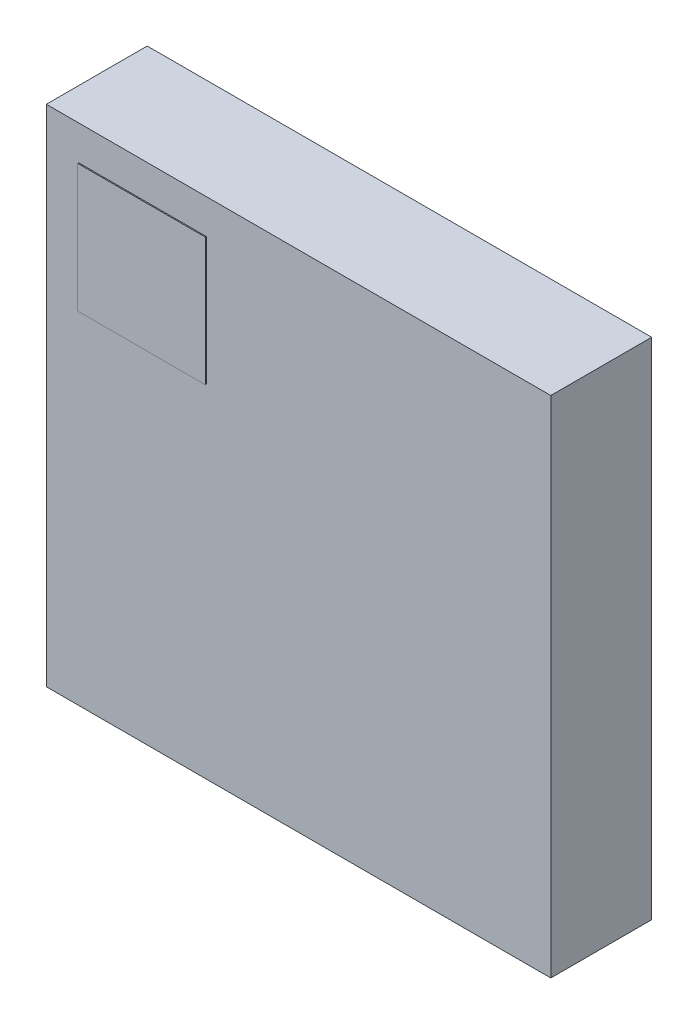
ISO-10303-21;
HEADER;
FILE_DESCRIPTION(('STEP AP214'),'2;1');
FILE_NAME('part.step','',(''),(''),'','','');
FILE_SCHEMA(('AUTOMOTIVE_DESIGN { 1 0 10303 214 1 1 1 1 }'));
ENDSEC;
DATA;
#1=APPLICATION_CONTEXT('core data for automotive mechanical design processes');
#2=APPLICATION_PROTOCOL_DEFINITION('international standard','automotive_design',2000,#1);
#3=PRODUCT_CONTEXT('',#1,'mechanical');
#4=PRODUCT('Part','Part','',(#3));
#5=PRODUCT_RELATED_PRODUCT_CATEGORY('part','',(#4));
#6=PRODUCT_DEFINITION_FORMATION('','',#4);
#7=PRODUCT_DEFINITION_CONTEXT('part definition',#1,'design');
#8=PRODUCT_DEFINITION('design','',#6,#7);
#9=PRODUCT_DEFINITION_SHAPE('','',#8);
#10=(LENGTH_UNIT() NAMED_UNIT(*) SI_UNIT(.MILLI.,.METRE.));
#11=(NAMED_UNIT(*) PLANE_ANGLE_UNIT() SI_UNIT($,.RADIAN.));
#12=(NAMED_UNIT(*) SI_UNIT($,.STERADIAN.) SOLID_ANGLE_UNIT());
#13=UNCERTAINTY_MEASURE_WITH_UNIT(LENGTH_MEASURE(1.E-05),#10,'distance_accuracy_value','');
#14=(GEOMETRIC_REPRESENTATION_CONTEXT(3) GLOBAL_UNCERTAINTY_ASSIGNED_CONTEXT((#13)) GLOBAL_UNIT_ASSIGNED_CONTEXT((#10,
#11,#12)) REPRESENTATION_CONTEXT('',''));
#15=CARTESIAN_POINT('',(0.,0.,0.));
#16=DIRECTION('',(0.,0.,1.));
#17=DIRECTION('',(1.,0.,0.));
#18=AXIS2_PLACEMENT_3D('',#15,#16,#17);
#19=CARTESIAN_POINT('',(-0.914278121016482,2.1578620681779,0.010160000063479));
#20=DIRECTION('',(0.999999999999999,4.37113882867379E-08,0.));
#21=DIRECTION('',(4.37113882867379E-08,-0.999999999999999,0.));
#22=AXIS2_PLACEMENT_3D('',#19,#20,#21);
#23=PLANE('',#22);
#24=DIRECTION('',(0.,0.,1.));
#25=VECTOR('',#24,1.);
#26=CARTESIAN_POINT('',(-0.914278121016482,2.1578620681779,0.010160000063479));
#27=LINE('',#26,#25);
#28=CARTESIAN_POINT('',(-0.914278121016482,2.1578620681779,0.010160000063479));
#29=VERTEX_POINT('',#28);
#30=CARTESIAN_POINT('',(-0.914278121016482,2.1578620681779,1.01016054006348));
#31=VERTEX_POINT('',#30);
#32=EDGE_CURVE('P0_E11',#29,#31,#27,.T.);
#33=ORIENTED_EDGE('',*,*,#32,.T.);
#34=DIRECTION('',(4.37113882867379E-08,-0.999999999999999,0.));
#35=VECTOR('',#34,1.);
#36=CARTESIAN_POINT('',(-0.914278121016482,2.1578620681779,1.01016054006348));
#37=LINE('',#36,#35);
#38=CARTESIAN_POINT('',(-0.914278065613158,0.890381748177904,1.01016054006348));
#39=VERTEX_POINT('',#38);
#40=EDGE_CURVE('P0_E24',#31,#39,#37,.T.);
#41=ORIENTED_EDGE('',*,*,#40,.T.);
#42=DIRECTION('',(0.,0.,1.));
#43=VECTOR('',#42,1.);
#44=CARTESIAN_POINT('',(-0.914278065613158,0.890381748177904,0.010160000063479));
#45=LINE('',#44,#43);
#46=CARTESIAN_POINT('',(-0.914278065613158,0.890381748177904,0.010160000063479));
#47=VERTEX_POINT('',#46);
#48=EDGE_CURVE('P0_E85',#47,#39,#45,.T.);
#49=ORIENTED_EDGE('',*,*,#48,.F.);
#50=DIRECTION('',(4.37113882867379E-08,-0.999999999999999,0.));
#51=VECTOR('',#50,1.);
#52=CARTESIAN_POINT('',(-0.914278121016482,2.1578620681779,0.010160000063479));
#53=LINE('',#52,#51);
#54=EDGE_CURVE('P0_E83',#29,#47,#53,.T.);
#55=ORIENTED_EDGE('',*,*,#54,.F.);
#56=EDGE_LOOP('',(#33,#41,#49,#55));
#57=FACE_BOUND('',#56,.T.);
#58=ADVANCED_FACE('P0_F17',(#57),#23,.T.);
#59=CARTESIAN_POINT('',(-0.914278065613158,0.890381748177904,0.010160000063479));
#60=DIRECTION('',(4.37113882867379E-08,-0.999999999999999,0.));
#61=DIRECTION('',(-0.999999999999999,-4.37113882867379E-08,0.));
#62=AXIS2_PLACEMENT_3D('',#59,#60,#61);
#63=PLANE('',#62);
#64=ORIENTED_EDGE('',*,*,#48,.T.);
#65=DIRECTION('',(-0.999999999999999,-4.37113882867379E-08,0.));
#66=VECTOR('',#65,1.);
#67=CARTESIAN_POINT('',(-0.914278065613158,0.890381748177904,1.01016054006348));
#68=LINE('',#67,#66);
#69=CARTESIAN_POINT('',(-2.17923870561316,0.890381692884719,1.01016054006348));
#70=VERTEX_POINT('',#69);
#71=EDGE_CURVE('P0_E81',#39,#70,#68,.T.);
#72=ORIENTED_EDGE('',*,*,#71,.T.);
#73=DIRECTION('',(0.,0.,1.));
#74=VECTOR('',#73,1.);
#75=CARTESIAN_POINT('',(-2.17923870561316,0.890381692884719,0.010160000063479));
#76=LINE('',#75,#74);
#77=CARTESIAN_POINT('',(-2.17923870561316,0.890381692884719,0.010160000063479));
#78=VERTEX_POINT('',#77);
#79=EDGE_CURVE('P0_E79',#78,#70,#76,.T.);
#80=ORIENTED_EDGE('',*,*,#79,.F.);
#81=DIRECTION('',(-0.999999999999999,-4.37113882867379E-08,0.));
#82=VECTOR('',#81,1.);
#83=CARTESIAN_POINT('',(-0.914278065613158,0.890381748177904,0.010160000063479));
#84=LINE('',#83,#82);
#85=EDGE_CURVE('P0_E69',#47,#78,#84,.T.);
#86=ORIENTED_EDGE('',*,*,#85,.F.);
#87=EDGE_LOOP('',(#64,#72,#80,#86));
#88=FACE_BOUND('',#87,.T.);
#89=ADVANCED_FACE('P0_F90',(#88),#63,.T.);
#90=CARTESIAN_POINT('',(-2.17923870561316,0.890381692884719,0.010160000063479));
#91=DIRECTION('',(-0.999999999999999,-4.37113882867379E-08,0.));
#92=DIRECTION('',(-4.37113882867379E-08,0.999999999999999,0.));
#93=AXIS2_PLACEMENT_3D('',#90,#91,#92);
#94=PLANE('',#93);
#95=ORIENTED_EDGE('',*,*,#79,.T.);
#96=DIRECTION('',(-4.37113882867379E-08,0.999999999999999,0.));
#97=VECTOR('',#96,1.);
#98=CARTESIAN_POINT('',(-2.17923870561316,0.890381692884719,1.01016054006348));
#99=LINE('',#98,#97);
#100=CARTESIAN_POINT('',(-2.17923876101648,2.15786201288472,1.01016054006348));
#101=VERTEX_POINT('',#100);
#102=EDGE_CURVE('P0_E60',#70,#101,#99,.T.);
#103=ORIENTED_EDGE('',*,*,#102,.T.);
#104=DIRECTION('',(0.,0.,1.));
#105=VECTOR('',#104,1.);
#106=CARTESIAN_POINT('',(-2.17923876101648,2.15786201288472,0.010160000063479));
#107=LINE('',#106,#105);
#108=CARTESIAN_POINT('',(-2.17923876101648,2.15786201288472,0.010160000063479));
#109=VERTEX_POINT('',#108);
#110=EDGE_CURVE('P0_E54',#109,#101,#107,.T.);
#111=ORIENTED_EDGE('',*,*,#110,.F.);
#112=DIRECTION('',(-4.37113882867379E-08,0.999999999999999,0.));
#113=VECTOR('',#112,1.);
#114=CARTESIAN_POINT('',(-2.17923870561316,0.890381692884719,0.010160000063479));
#115=LINE('',#114,#113);
#116=EDGE_CURVE('P0_E58',#78,#109,#115,.T.);
#117=ORIENTED_EDGE('',*,*,#116,.F.);
#118=EDGE_LOOP('',(#95,#103,#111,#117));
#119=FACE_BOUND('',#118,.T.);
#120=ADVANCED_FACE('P0_F57',(#119),#94,.T.);
#121=CARTESIAN_POINT('',(-2.17923876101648,2.15786201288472,0.010160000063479));
#122=DIRECTION('',(-4.37113882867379E-08,0.999999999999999,0.));
#123=DIRECTION('',(0.999999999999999,4.37113882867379E-08,0.));
#124=AXIS2_PLACEMENT_3D('',#121,#122,#123);
#125=PLANE('',#124);
#126=ORIENTED_EDGE('',*,*,#110,.T.);
#127=DIRECTION('',(0.999999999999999,4.37113882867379E-08,0.));
#128=VECTOR('',#127,1.);
#129=CARTESIAN_POINT('',(-2.17923876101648,2.15786201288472,1.01016054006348));
#130=LINE('',#129,#128);
#131=EDGE_CURVE('P0_E71',#101,#31,#130,.T.);
#132=ORIENTED_EDGE('',*,*,#131,.T.);
#133=ORIENTED_EDGE('',*,*,#32,.F.);
#134=DIRECTION('',(0.999999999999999,4.37113882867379E-08,0.));
#135=VECTOR('',#134,1.);
#136=CARTESIAN_POINT('',(-2.17923876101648,2.15786201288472,0.010160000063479));
#137=LINE('',#136,#135);
#138=EDGE_CURVE('P0_E67',#109,#29,#137,.T.);
#139=ORIENTED_EDGE('',*,*,#138,.F.);
#140=EDGE_LOOP('',(#126,#132,#133,#139));
#141=FACE_BOUND('',#140,.T.);
#142=ADVANCED_FACE('P0_F73',(#141),#125,.T.);
#143=CARTESIAN_POINT('',(-0.914278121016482,2.1578620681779,0.010160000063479));
#144=DIRECTION('',(0.,0.,1.));
#145=DIRECTION('',(-4.37113882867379E-08,0.999999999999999,0.));
#146=AXIS2_PLACEMENT_3D('',#143,#144,#145);
#147=PLANE('',#146);
#148=ORIENTED_EDGE('',*,*,#54,.T.);
#149=ORIENTED_EDGE('',*,*,#85,.T.);
#150=ORIENTED_EDGE('',*,*,#116,.T.);
#151=ORIENTED_EDGE('',*,*,#138,.T.);
#152=EDGE_LOOP('',(#148,#149,#150,#151));
#153=FACE_BOUND('',#152,.T.);
#154=ADVANCED_FACE('P0_F66',(#153),#147,.F.);
#155=CARTESIAN_POINT('',(-0.914278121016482,2.1578620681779,1.01016054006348));
#156=DIRECTION('',(0.,0.,1.));
#157=DIRECTION('',(-4.37113882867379E-08,0.999999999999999,0.));
#158=AXIS2_PLACEMENT_3D('',#155,#156,#157);
#159=PLANE('',#158);
#160=ORIENTED_EDGE('',*,*,#131,.F.);
#161=ORIENTED_EDGE('',*,*,#102,.F.);
#162=ORIENTED_EDGE('',*,*,#71,.F.);
#163=ORIENTED_EDGE('',*,*,#40,.F.);
#164=EDGE_LOOP('',(#160,#161,#162,#163));
#165=FACE_BOUND('',#164,.T.);
#166=ADVANCED_FACE('P0_F91',(#165),#159,.T.);
#167=CLOSED_SHELL('',(#58,#89,#120,#142,#154,#166));
#168=MANIFOLD_SOLID_BREP('P0_B1',#167);
#169=CARTESIAN_POINT('',(2.49999997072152,2.50000018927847,0.));
#170=DIRECTION('',(0.999999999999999,4.37113882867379E-08,0.));
#171=DIRECTION('',(4.37113882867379E-08,-0.999999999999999,0.));
#172=AXIS2_PLACEMENT_3D('',#169,#170,#171);
#173=PLANE('',#172);
#174=DIRECTION('',(0.,0.,1.));
#175=VECTOR('',#174,1.);
#176=CARTESIAN_POINT('',(2.49999997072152,2.50000018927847,0.));
#177=LINE('',#176,#175);
#178=CARTESIAN_POINT('',(2.49999997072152,2.50000018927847,0.));
#179=VERTEX_POINT('',#178);
#180=CARTESIAN_POINT('',(2.49999997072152,2.50000018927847,1.00000054));
#181=VERTEX_POINT('',#180);
#182=EDGE_CURVE('P1_E11',#179,#181,#177,.T.);
#183=ORIENTED_EDGE('',*,*,#182,.T.);
#184=DIRECTION('',(4.37113882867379E-08,-0.999999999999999,0.));
#185=VECTOR('',#184,1.);
#186=CARTESIAN_POINT('',(2.49999997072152,2.50000018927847,1.00000054));
#187=LINE('',#186,#185);
#188=CARTESIAN_POINT('',(2.50000018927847,-2.49999997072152,1.00000054));
#189=VERTEX_POINT('',#188);
#190=EDGE_CURVE('P1_E24',#181,#189,#187,.T.);
#191=ORIENTED_EDGE('',*,*,#190,.T.);
#192=DIRECTION('',(0.,0.,1.));
#193=VECTOR('',#192,1.);
#194=CARTESIAN_POINT('',(2.50000018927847,-2.49999997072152,0.));
#195=LINE('',#194,#193);
#196=CARTESIAN_POINT('',(2.50000018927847,-2.49999997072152,0.));
#197=VERTEX_POINT('',#196);
#198=EDGE_CURVE('P1_E84',#197,#189,#195,.T.);
#199=ORIENTED_EDGE('',*,*,#198,.F.);
#200=DIRECTION('',(4.37113882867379E-08,-0.999999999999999,0.));
#201=VECTOR('',#200,1.);
#202=CARTESIAN_POINT('',(2.49999997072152,2.50000018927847,0.));
#203=LINE('',#202,#201);
#204=EDGE_CURVE('P1_E82',#179,#197,#203,.T.);
#205=ORIENTED_EDGE('',*,*,#204,.F.);
#206=EDGE_LOOP('',(#183,#191,#199,#205));
#207=FACE_BOUND('',#206,.T.);
#208=ADVANCED_FACE('P1_F17',(#207),#173,.T.);
#209=CARTESIAN_POINT('',(2.50000018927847,-2.49999997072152,0.));
#210=DIRECTION('',(4.37113882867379E-08,-0.999999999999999,0.));
#211=DIRECTION('',(-0.999999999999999,-4.37113882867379E-08,0.));
#212=AXIS2_PLACEMENT_3D('',#209,#210,#211);
#213=PLANE('',#212);
#214=ORIENTED_EDGE('',*,*,#198,.T.);
#215=DIRECTION('',(-0.999999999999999,-4.37113882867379E-08,0.));
#216=VECTOR('',#215,1.);
#217=CARTESIAN_POINT('',(2.50000018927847,-2.49999997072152,1.00000054));
#218=LINE('',#217,#216);
#219=CARTESIAN_POINT('',(-2.49999997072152,-2.50000018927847,1.00000054));
#220=VERTEX_POINT('',#219);
#221=EDGE_CURVE('P1_E79',#189,#220,#218,.T.);
#222=ORIENTED_EDGE('',*,*,#221,.T.);
#223=DIRECTION('',(0.,0.,1.));
#224=VECTOR('',#223,1.);
#225=CARTESIAN_POINT('',(-2.49999997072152,-2.50000018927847,0.));
#226=LINE('',#225,#224);
#227=CARTESIAN_POINT('',(-2.49999997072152,-2.50000018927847,0.));
#228=VERTEX_POINT('',#227);
#229=EDGE_CURVE('P1_E77',#228,#220,#226,.T.);
#230=ORIENTED_EDGE('',*,*,#229,.F.);
#231=DIRECTION('',(-0.999999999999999,-4.37113882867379E-08,0.));
#232=VECTOR('',#231,1.);
#233=CARTESIAN_POINT('',(2.50000018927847,-2.49999997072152,0.));
#234=LINE('',#233,#232);
#235=EDGE_CURVE('P1_E68',#197,#228,#234,.T.);
#236=ORIENTED_EDGE('',*,*,#235,.F.);
#237=EDGE_LOOP('',(#214,#222,#230,#236));
#238=FACE_BOUND('',#237,.T.);
#239=ADVANCED_FACE('P1_F90',(#238),#213,.T.);
#240=CARTESIAN_POINT('',(-2.49999997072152,-2.50000018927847,0.));
#241=DIRECTION('',(-0.999999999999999,-4.37113882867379E-08,0.));
#242=DIRECTION('',(-4.37113882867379E-08,0.999999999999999,0.));
#243=AXIS2_PLACEMENT_3D('',#240,#241,#242);
#244=PLANE('',#243);
#245=ORIENTED_EDGE('',*,*,#229,.T.);
#246=DIRECTION('',(-4.37113882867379E-08,0.999999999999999,0.));
#247=VECTOR('',#246,1.);
#248=CARTESIAN_POINT('',(-2.49999997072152,-2.50000018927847,1.00000054));
#249=LINE('',#248,#247);
#250=CARTESIAN_POINT('',(-2.50000018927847,2.49999997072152,1.00000054));
#251=VERTEX_POINT('',#250);
#252=EDGE_CURVE('P1_E60',#220,#251,#249,.T.);
#253=ORIENTED_EDGE('',*,*,#252,.T.);
#254=DIRECTION('',(0.,0.,1.));
#255=VECTOR('',#254,1.);
#256=CARTESIAN_POINT('',(-2.50000018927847,2.49999997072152,0.));
#257=LINE('',#256,#255);
#258=CARTESIAN_POINT('',(-2.50000018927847,2.49999997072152,0.));
#259=VERTEX_POINT('',#258);
#260=EDGE_CURVE('P1_E54',#259,#251,#257,.T.);
#261=ORIENTED_EDGE('',*,*,#260,.F.);
#262=DIRECTION('',(-4.37113882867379E-08,0.999999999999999,0.));
#263=VECTOR('',#262,1.);
#264=CARTESIAN_POINT('',(-2.49999997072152,-2.50000018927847,0.));
#265=LINE('',#264,#263);
#266=EDGE_CURVE('P1_E58',#228,#259,#265,.T.);
#267=ORIENTED_EDGE('',*,*,#266,.F.);
#268=EDGE_LOOP('',(#245,#253,#261,#267));
#269=FACE_BOUND('',#268,.T.);
#270=ADVANCED_FACE('P1_F57',(#269),#244,.T.);
#271=CARTESIAN_POINT('',(-2.50000018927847,2.49999997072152,0.));
#272=DIRECTION('',(-4.37113882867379E-08,0.999999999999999,0.));
#273=DIRECTION('',(0.999999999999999,4.37113882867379E-08,0.));
#274=AXIS2_PLACEMENT_3D('',#271,#272,#273);
#275=PLANE('',#274);
#276=ORIENTED_EDGE('',*,*,#260,.T.);
#277=DIRECTION('',(0.999999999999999,4.37113882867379E-08,0.));
#278=VECTOR('',#277,1.);
#279=CARTESIAN_POINT('',(-2.50000018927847,2.49999997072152,1.00000054));
#280=LINE('',#279,#278);
#281=EDGE_CURVE('P1_E69',#251,#181,#280,.T.);
#282=ORIENTED_EDGE('',*,*,#281,.T.);
#283=ORIENTED_EDGE('',*,*,#182,.F.);
#284=DIRECTION('',(0.999999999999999,4.37113882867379E-08,0.));
#285=VECTOR('',#284,1.);
#286=CARTESIAN_POINT('',(-2.50000018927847,2.49999997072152,0.));
#287=LINE('',#286,#285);
#288=EDGE_CURVE('P1_E67',#259,#179,#287,.T.);
#289=ORIENTED_EDGE('',*,*,#288,.F.);
#290=EDGE_LOOP('',(#276,#282,#283,#289));
#291=FACE_BOUND('',#290,.T.);
#292=ADVANCED_FACE('P1_F71',(#291),#275,.T.);
#293=CARTESIAN_POINT('',(2.49999997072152,2.50000018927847,0.));
#294=DIRECTION('',(0.,0.,1.));
#295=DIRECTION('',(-4.37113882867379E-08,0.999999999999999,0.));
#296=AXIS2_PLACEMENT_3D('',#293,#294,#295);
#297=PLANE('',#296);
#298=ORIENTED_EDGE('',*,*,#204,.T.);
#299=ORIENTED_EDGE('',*,*,#235,.T.);
#300=ORIENTED_EDGE('',*,*,#266,.T.);
#301=ORIENTED_EDGE('',*,*,#288,.T.);
#302=EDGE_LOOP('',(#298,#299,#300,#301));
#303=FACE_BOUND('',#302,.T.);
#304=ADVANCED_FACE('P1_F66',(#303),#297,.F.);
#305=CARTESIAN_POINT('',(2.49999997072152,2.50000018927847,1.00000054));
#306=DIRECTION('',(0.,0.,1.));
#307=DIRECTION('',(-4.37113882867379E-08,0.999999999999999,0.));
#308=AXIS2_PLACEMENT_3D('',#305,#306,#307);
#309=PLANE('',#308);
#310=ORIENTED_EDGE('',*,*,#281,.F.);
#311=ORIENTED_EDGE('',*,*,#252,.F.);
#312=ORIENTED_EDGE('',*,*,#221,.F.);
#313=ORIENTED_EDGE('',*,*,#190,.F.);
#314=EDGE_LOOP('',(#310,#311,#312,#313));
#315=FACE_BOUND('',#314,.T.);
#316=ADVANCED_FACE('P1_F91',(#315),#309,.T.);
#317=CLOSED_SHELL('',(#208,#239,#270,#292,#304,#316));
#318=MANIFOLD_SOLID_BREP('P1_B1',#317);
#319=ADVANCED_BREP_SHAPE_REPRESENTATION('',(#18,#168,#318),#14);
#320=SHAPE_DEFINITION_REPRESENTATION(#9,#319);
ENDSEC;
END-ISO-10303-21;
